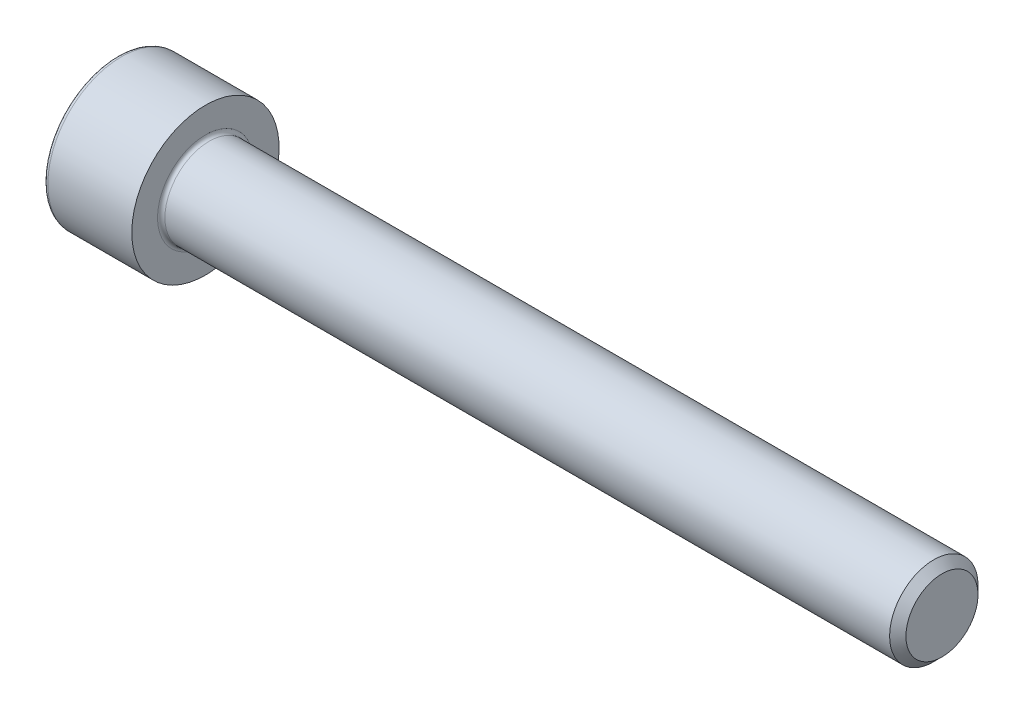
from build123d import *

# Parameters (mm, degrees)
FILLET1_R   = 0.25
FILLET2_R   = 0.3
HEX_2_DEPTH = 3


with BuildPart() as part:
    # BodySke → Base-Revolve (revolve)
    with BuildSketch(Plane.XY, mode=Mode.PRIVATE) as base_revolve_sk:
        Polygon((0, 0), (0, 5), (6, 5), (6, 3), (55.4455, 3), (56, 2.4455), (56, 0), align=None)
    revolve(base_revolve_sk.sketch.rotate(Axis((-31.75, 0, 0), (1, 0, 0)), 90), axis=Axis((-31.75, 0, 0), (1, 0, 0)))

    # Fillet1
    fillet1_edges = [part.edges().sort_by_distance(p)[0] for p in [
        (6, 0, -3),
    ]]
    fillet(fillet1_edges, radius=FILLET1_R)

    # Fillet2
    fillet2_edges = [part.edges().sort_by_distance(p)[0] for p in [
        (0, 0, -5),
    ]]
    fillet(fillet2_edges, radius=FILLET2_R)

    # Sketch2 → Hex-PreBroach (revolve, cut)
    with BuildSketch(Plane.XY, mode=Mode.PRIVATE) as hex_prebroach_sk:
        Polygon((0, 2.542), (3, 2.542), (4.467624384, 0), (0, 0), align=None)
    revolve(hex_prebroach_sk.sketch.rotate(Axis((0, 0, 0), (1, 0, 0)), 90), axis=Axis((0, 0, 0), (1, 0, 0)), mode=Mode.SUBTRACT)

    # Sketch3 → Hex 2 (cut)
    with BuildSketch(Plane(origin=(0, 0, 0), x_dir=(0, 0.500000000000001, 0.866025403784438), z_dir=(-1, 0, 0))):
        Polygon((1.467624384, 2.542), (-1.467624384, 2.542), (-2.935248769, 0), (-1.467624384, -2.542), (1.467624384, -2.542), (2.935248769, 0), align=None)
    extrude(amount=-HEX_2_DEPTH, mode=Mode.SUBTRACT)


solid = part.part
